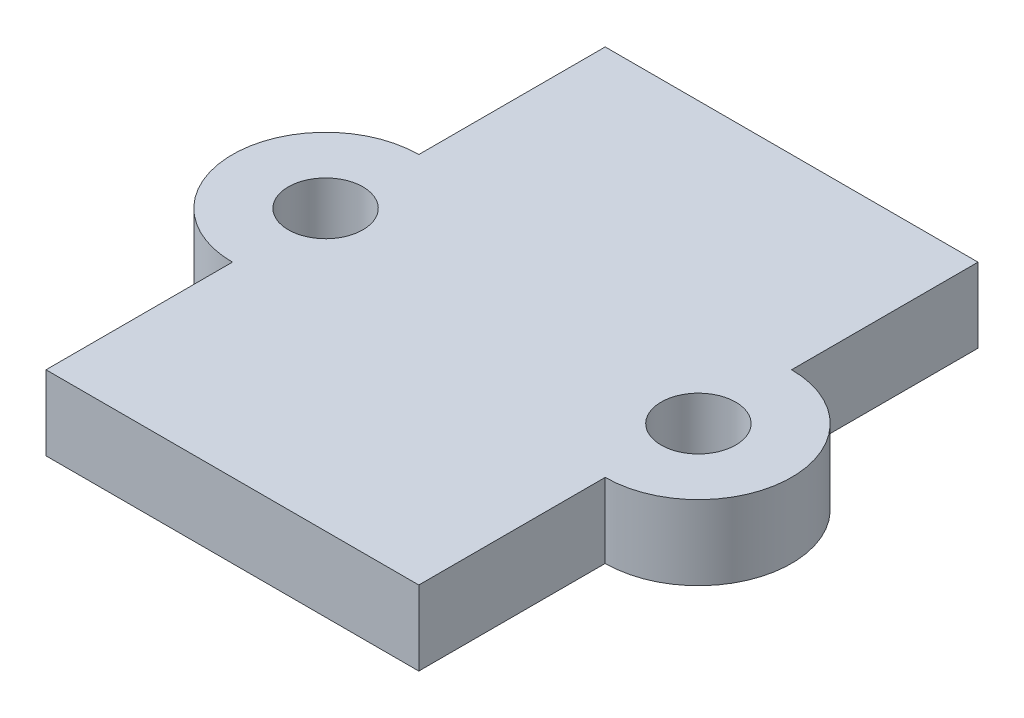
from build123d import *

# Parameters (mm, degrees)
SKETCH1_W           = 10
SKETCH1_H           = 15
BOSS_EXTRUDE1_DEPTH = 2
BOSS_EXTRUDE2_DEPTH = 2
SKETCH3_R           = 1
CUT_EXTRUDE1_DEPTH  = 2


with BuildPart() as part:
    # Sketch1 → Boss-Extrude1 (new body)
    with BuildSketch(Plane(origin=(0, 0, 0), x_dir=(1, 0, 0), z_dir=(0, 1, 0))):
        Rectangle(SKETCH1_W, SKETCH1_H)
    extrude(amount=BOSS_EXTRUDE1_DEPTH)

    # Sketch2 → Boss-Extrude2 (add)
    with BuildSketch(Plane(origin=(0, 2, 0), x_dir=(1, 0, 0), z_dir=(0, 1, 0))):
        with BuildLine():
            Line((-5, 2.5), (5, 2.5))
            ThreePointArc((5, 2.5), (7.5, 0), (5, -2.5))
            Line((5, -2.5), (-5, -2.5))
            ThreePointArc((-5, -2.5), (-7.5, 0), (-5, 2.5))
        make_face()
    extrude(amount=-BOSS_EXTRUDE2_DEPTH)

    # Sketch3 → Cut-Extrude1 (cut)
    with BuildSketch(Plane.XZ):
        with Locations(Location((-5, 0, 0), (0, 0, 270))):
            Circle(SKETCH3_R)
        with Locations(Location((5, 0, 0), (0, 0, 270))):
            Circle(SKETCH3_R)
    extrude(amount=-CUT_EXTRUDE1_DEPTH, mode=Mode.SUBTRACT)


solid = part.part
